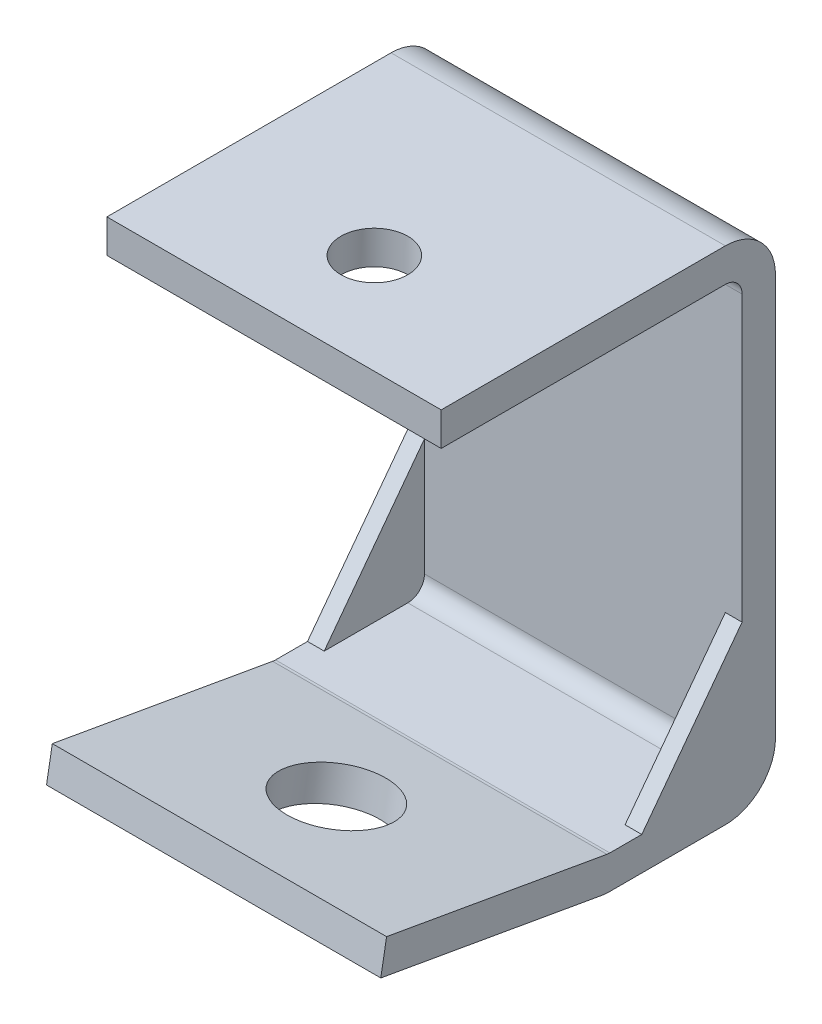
ISO-10303-21;
HEADER;
FILE_DESCRIPTION(('STEP AP214'),'2;1');
FILE_NAME('part.step','',(''),(''),'','','');
FILE_SCHEMA(('AUTOMOTIVE_DESIGN { 1 0 10303 214 1 1 1 1 }'));
ENDSEC;
DATA;
#1=APPLICATION_CONTEXT('core data for automotive mechanical design processes');
#2=APPLICATION_PROTOCOL_DEFINITION('international standard','automotive_design',2000,#1);
#3=PRODUCT_CONTEXT('',#1,'mechanical');
#4=PRODUCT('Part','Part','',(#3));
#5=PRODUCT_RELATED_PRODUCT_CATEGORY('part','',(#4));
#6=PRODUCT_DEFINITION_FORMATION('','',#4);
#7=PRODUCT_DEFINITION_CONTEXT('part definition',#1,'design');
#8=PRODUCT_DEFINITION('design','',#6,#7);
#9=PRODUCT_DEFINITION_SHAPE('','',#8);
#10=(LENGTH_UNIT() NAMED_UNIT(*) SI_UNIT(.MILLI.,.METRE.));
#11=(NAMED_UNIT(*) PLANE_ANGLE_UNIT() SI_UNIT($,.RADIAN.));
#12=(NAMED_UNIT(*) SI_UNIT($,.STERADIAN.) SOLID_ANGLE_UNIT());
#13=UNCERTAINTY_MEASURE_WITH_UNIT(LENGTH_MEASURE(1.E-05),#10,'distance_accuracy_value','');
#14=(GEOMETRIC_REPRESENTATION_CONTEXT(3) GLOBAL_UNCERTAINTY_ASSIGNED_CONTEXT((#13)) GLOBAL_UNIT_ASSIGNED_CONTEXT((#10,
#11,#12)) REPRESENTATION_CONTEXT('',''));
#15=CARTESIAN_POINT('',(0.,0.,0.));
#16=DIRECTION('',(0.,0.,1.));
#17=DIRECTION('',(1.,0.,0.));
#18=AXIS2_PLACEMENT_3D('',#15,#16,#17);
#19=CARTESIAN_POINT('',(31.75,3.175,3.175));
#20=DIRECTION('',(-1.,0.,0.));
#21=DIRECTION('',(0.,0.,1.));
#22=AXIS2_PLACEMENT_3D('',#19,#20,#21);
#23=CYLINDRICAL_SURFACE('',#22,3.175);
#24=DIRECTION('',(-1.,0.,0.));
#25=VECTOR('',#24,1.);
#26=CARTESIAN_POINT('',(31.75,3.175,0.));
#27=LINE('',#26,#25);
#28=CARTESIAN_POINT('',(28.575,3.175,0.));
#29=VERTEX_POINT('',#28);
#30=CARTESIAN_POINT('',(-28.575,3.175,0.));
#31=VERTEX_POINT('',#30);
#32=EDGE_CURVE('E320',#29,#31,#27,.T.);
#33=ORIENTED_EDGE('',*,*,#32,.T.);
#34=CARTESIAN_POINT('',(-28.575,3.175,3.175));
#35=DIRECTION('',(1.,0.,0.));
#36=DIRECTION('',(0.,0.,-1.));
#37=AXIS2_PLACEMENT_3D('',#34,#35,#36);
#38=CIRCLE('',#37,3.175);
#39=CARTESIAN_POINT('',(-28.575,0.,3.175));
#40=VERTEX_POINT('',#39);
#41=EDGE_CURVE('E192',#40,#31,#38,.T.);
#42=ORIENTED_EDGE('',*,*,#41,.F.);
#43=DIRECTION('',(-1.,0.,0.));
#44=VECTOR('',#43,1.);
#45=CARTESIAN_POINT('',(31.75,0.,3.175));
#46=LINE('',#45,#44);
#47=CARTESIAN_POINT('',(28.575,0.,3.175));
#48=VERTEX_POINT('',#47);
#49=EDGE_CURVE('E191',#48,#40,#46,.T.);
#50=ORIENTED_EDGE('',*,*,#49,.F.);
#51=CARTESIAN_POINT('',(28.575,3.175,3.175));
#52=DIRECTION('',(1.,0.,0.));
#53=DIRECTION('',(0.,0.,-1.));
#54=AXIS2_PLACEMENT_3D('',#51,#52,#53);
#55=CIRCLE('',#54,3.175);
#56=EDGE_CURVE('E203',#48,#29,#55,.T.);
#57=ORIENTED_EDGE('',*,*,#56,.T.);
#58=EDGE_LOOP('',(#33,#42,#50,#57));
#59=FACE_BOUND('',#58,.T.);
#60=ADVANCED_FACE('F32',(#59),#23,.F.);
#61=CARTESIAN_POINT('',(31.75,3.175,0.));
#62=DIRECTION('',(0.,0.,1.));
#63=DIRECTION('',(1.,0.,0.));
#64=AXIS2_PLACEMENT_3D('',#61,#62,#63);
#65=PLANE('',#64);
#66=DIRECTION('',(-1.,0.,0.));
#67=VECTOR('',#66,1.);
#68=CARTESIAN_POINT('',(-28.575,25.4,0.));
#69=LINE('',#68,#67);
#70=CARTESIAN_POINT('',(-28.575,25.4,0.));
#71=VERTEX_POINT('',#70);
#72=CARTESIAN_POINT('',(-31.75,25.4,0.));
#73=VERTEX_POINT('',#72);
#74=EDGE_CURVE('E179',#71,#73,#69,.T.);
#75=ORIENTED_EDGE('',*,*,#74,.F.);
#76=DIRECTION('',(0.,1.,0.));
#77=VECTOR('',#76,1.);
#78=CARTESIAN_POINT('',(-28.575,3.175,0.));
#79=LINE('',#78,#77);
#80=EDGE_CURVE('E186',#31,#71,#79,.T.);
#81=ORIENTED_EDGE('',*,*,#80,.F.);
#82=ORIENTED_EDGE('',*,*,#32,.F.);
#83=DIRECTION('',(0.,1.,0.));
#84=VECTOR('',#83,1.);
#85=CARTESIAN_POINT('',(28.575,3.175,0.));
#86=LINE('',#85,#84);
#87=CARTESIAN_POINT('',(28.575,25.4,0.));
#88=VERTEX_POINT('',#87);
#89=EDGE_CURVE('E56',#29,#88,#86,.T.);
#90=ORIENTED_EDGE('',*,*,#89,.T.);
#91=DIRECTION('',(1.,0.,0.));
#92=VECTOR('',#91,1.);
#93=CARTESIAN_POINT('',(28.575,25.4,0.));
#94=LINE('',#93,#92);
#95=CARTESIAN_POINT('',(31.75,25.4,0.));
#96=VERTEX_POINT('',#95);
#97=EDGE_CURVE('E212',#88,#96,#94,.T.);
#98=ORIENTED_EDGE('',*,*,#97,.T.);
#99=DIRECTION('',(0.,1.,0.));
#100=VECTOR('',#99,1.);
#101=CARTESIAN_POINT('',(31.75,3.175,0.));
#102=LINE('',#101,#100);
#103=CARTESIAN_POINT('',(31.75,79.375,0.));
#104=VERTEX_POINT('',#103);
#105=EDGE_CURVE('E233',#96,#104,#102,.T.);
#106=ORIENTED_EDGE('',*,*,#105,.T.);
#107=DIRECTION('',(-1.,0.,0.));
#108=VECTOR('',#107,1.);
#109=CARTESIAN_POINT('',(31.75,79.375,0.));
#110=LINE('',#109,#108);
#111=CARTESIAN_POINT('',(-31.75,79.375,0.));
#112=VERTEX_POINT('',#111);
#113=EDGE_CURVE('E323',#104,#112,#110,.T.);
#114=ORIENTED_EDGE('',*,*,#113,.T.);
#115=DIRECTION('',(0.,1.,0.));
#116=VECTOR('',#115,1.);
#117=CARTESIAN_POINT('',(-31.75,3.175,0.));
#118=LINE('',#117,#116);
#119=EDGE_CURVE('E270',#73,#112,#118,.T.);
#120=ORIENTED_EDGE('',*,*,#119,.F.);
#121=EDGE_LOOP('',(#75,#81,#82,#90,#98,#106,#114,#120));
#122=FACE_BOUND('',#121,.T.);
#123=ADVANCED_FACE('F413',(#122),#65,.T.);
#124=CARTESIAN_POINT('',(31.75,0.,25.1222234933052));
#125=DIRECTION('',(0.,1.,0.));
#126=DIRECTION('',(0.,0.,1.));
#127=AXIS2_PLACEMENT_3D('',#124,#125,#126);
#128=PLANE('',#127);
#129=DIRECTION('',(-1.,0.,0.));
#130=VECTOR('',#129,1.);
#131=CARTESIAN_POINT('',(-28.575,0.,19.05));
#132=LINE('',#131,#130);
#133=CARTESIAN_POINT('',(-28.575,0.,19.05));
#134=VERTEX_POINT('',#133);
#135=CARTESIAN_POINT('',(-31.75,0.,19.05));
#136=VERTEX_POINT('',#135);
#137=EDGE_CURVE('E170',#134,#136,#132,.T.);
#138=ORIENTED_EDGE('',*,*,#137,.T.);
#139=DIRECTION('',(0.,0.,-1.));
#140=VECTOR('',#139,1.);
#141=CARTESIAN_POINT('',(-31.75,0.,25.1222234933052));
#142=LINE('',#141,#140);
#143=CARTESIAN_POINT('',(-31.75,0.,25.1222234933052));
#144=VERTEX_POINT('',#143);
#145=EDGE_CURVE('E272',#144,#136,#142,.T.);
#146=ORIENTED_EDGE('',*,*,#145,.F.);
#147=DIRECTION('',(-1.,0.,0.));
#148=VECTOR('',#147,1.);
#149=CARTESIAN_POINT('',(31.75,0.,25.1222234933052));
#150=LINE('',#149,#148);
#151=CARTESIAN_POINT('',(31.75,0.,25.1222234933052));
#152=VERTEX_POINT('',#151);
#153=EDGE_CURVE('E317',#152,#144,#150,.T.);
#154=ORIENTED_EDGE('',*,*,#153,.F.);
#155=DIRECTION('',(0.,0.,-1.));
#156=VECTOR('',#155,1.);
#157=CARTESIAN_POINT('',(31.75,0.,25.1222234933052));
#158=LINE('',#157,#156);
#159=CARTESIAN_POINT('',(31.75,0.,19.05));
#160=VERTEX_POINT('',#159);
#161=EDGE_CURVE('E235',#152,#160,#158,.T.);
#162=ORIENTED_EDGE('',*,*,#161,.T.);
#163=DIRECTION('',(1.,0.,0.));
#164=VECTOR('',#163,1.);
#165=CARTESIAN_POINT('',(28.575,0.,19.05));
#166=LINE('',#165,#164);
#167=CARTESIAN_POINT('',(28.575,0.,19.05));
#168=VERTEX_POINT('',#167);
#169=EDGE_CURVE('E207',#168,#160,#166,.T.);
#170=ORIENTED_EDGE('',*,*,#169,.F.);
#171=DIRECTION('',(0.,0.,-1.));
#172=VECTOR('',#171,1.);
#173=CARTESIAN_POINT('',(28.575,0.,19.05));
#174=LINE('',#173,#172);
#175=EDGE_CURVE('E205',#168,#48,#174,.T.);
#176=ORIENTED_EDGE('',*,*,#175,.T.);
#177=ORIENTED_EDGE('',*,*,#49,.T.);
#178=DIRECTION('',(0.,0.,-1.));
#179=VECTOR('',#178,1.);
#180=CARTESIAN_POINT('',(-28.575,0.,19.05));
#181=LINE('',#180,#179);
#182=EDGE_CURVE('E183',#134,#40,#181,.T.);
#183=ORIENTED_EDGE('',*,*,#182,.F.);
#184=EDGE_LOOP('',(#138,#146,#154,#162,#170,#176,#177,#183));
#185=FACE_BOUND('',#184,.T.);
#186=ADVANCED_FACE('F189',(#185),#128,.T.);
#187=CARTESIAN_POINT('',(31.75,88.9,3.175));
#188=DIRECTION('',(0.,-1.,0.));
#189=DIRECTION('',(0.,0.,-1.));
#190=AXIS2_PLACEMENT_3D('',#187,#188,#189);
#191=PLANE('',#190);
#192=CARTESIAN_POINT('',(0.,88.9,38.1));
#193=DIRECTION('',(0.,1.,0.));
#194=DIRECTION('',(0.,0.,1.));
#195=AXIS2_PLACEMENT_3D('',#192,#193,#194);
#196=CIRCLE('',#195,6.35);
#197=CARTESIAN_POINT('',(0.,88.9,44.45));
#198=VERTEX_POINT('',#197);
#199=EDGE_CURVE('E217',#198,#198,#196,.T.);
#200=ORIENTED_EDGE('',*,*,#199,.F.);
#201=EDGE_LOOP('',(#200));
#202=FACE_BOUND('',#201,.T.);
#203=DIRECTION('',(0.,0.,1.));
#204=VECTOR('',#203,1.);
#205=CARTESIAN_POINT('',(-31.75,88.9,3.175));
#206=LINE('',#205,#204);
#207=CARTESIAN_POINT('',(-31.75,88.9,3.175));
#208=VERTEX_POINT('',#207);
#209=CARTESIAN_POINT('',(-31.75,88.9,57.15));
#210=VERTEX_POINT('',#209);
#211=EDGE_CURVE('E220',#208,#210,#206,.T.);
#212=ORIENTED_EDGE('',*,*,#211,.T.);
#213=DIRECTION('',(-1.,0.,0.));
#214=VECTOR('',#213,1.);
#215=CARTESIAN_POINT('',(31.75,88.9,57.15));
#216=LINE('',#215,#214);
#217=CARTESIAN_POINT('',(31.75,88.9,57.15));
#218=VERTEX_POINT('',#217);
#219=EDGE_CURVE('E11',#218,#210,#216,.T.);
#220=ORIENTED_EDGE('',*,*,#219,.F.);
#221=DIRECTION('',(0.,0.,1.));
#222=VECTOR('',#221,1.);
#223=CARTESIAN_POINT('',(31.75,88.9,3.175));
#224=LINE('',#223,#222);
#225=CARTESIAN_POINT('',(31.75,88.9,3.175));
#226=VERTEX_POINT('',#225);
#227=EDGE_CURVE('E221',#226,#218,#224,.T.);
#228=ORIENTED_EDGE('',*,*,#227,.F.);
#229=DIRECTION('',(-1.,0.,0.));
#230=VECTOR('',#229,1.);
#231=CARTESIAN_POINT('',(31.75,88.9,3.175));
#232=LINE('',#231,#230);
#233=EDGE_CURVE('E258',#226,#208,#232,.T.);
#234=ORIENTED_EDGE('',*,*,#233,.T.);
#235=EDGE_LOOP('',(#212,#220,#228,#234));
#236=FACE_BOUND('',#235,.T.);
#237=ADVANCED_FACE('F34',(#202,#236),#191,.F.);
#238=CARTESIAN_POINT('',(31.75,82.55,57.15));
#239=DIRECTION('',(0.,0.,1.));
#240=DIRECTION('',(1.,0.,0.));
#241=AXIS2_PLACEMENT_3D('',#238,#239,#240);
#242=PLANE('',#241);
#243=DIRECTION('',(0.,1.,0.));
#244=VECTOR('',#243,1.);
#245=CARTESIAN_POINT('',(-31.75,82.55,57.15));
#246=LINE('',#245,#244);
#247=CARTESIAN_POINT('',(-31.75,82.55,57.15));
#248=VERTEX_POINT('',#247);
#249=EDGE_CURVE('E261',#248,#210,#246,.T.);
#250=ORIENTED_EDGE('',*,*,#249,.F.);
#251=DIRECTION('',(-1.,0.,0.));
#252=VECTOR('',#251,1.);
#253=CARTESIAN_POINT('',(31.75,82.55,57.15));
#254=LINE('',#253,#252);
#255=CARTESIAN_POINT('',(31.75,82.55,57.15));
#256=VERTEX_POINT('',#255);
#257=EDGE_CURVE('E41',#256,#248,#254,.T.);
#258=ORIENTED_EDGE('',*,*,#257,.F.);
#259=DIRECTION('',(0.,1.,0.));
#260=VECTOR('',#259,1.);
#261=CARTESIAN_POINT('',(31.75,82.55,57.15));
#262=LINE('',#261,#260);
#263=EDGE_CURVE('E223',#256,#218,#262,.T.);
#264=ORIENTED_EDGE('',*,*,#263,.T.);
#265=ORIENTED_EDGE('',*,*,#219,.T.);
#266=EDGE_LOOP('',(#250,#258,#264,#265));
#267=FACE_BOUND('',#266,.T.);
#268=ADVANCED_FACE('F335',(#267),#242,.T.);
#269=CARTESIAN_POINT('',(31.75,82.55,3.175));
#270=DIRECTION('',(0.,-1.,0.));
#271=DIRECTION('',(0.,0.,-1.));
#272=AXIS2_PLACEMENT_3D('',#269,#270,#271);
#273=PLANE('',#272);
#274=CARTESIAN_POINT('',(0.,82.55,38.1));
#275=DIRECTION('',(0.,-1.,0.));
#276=DIRECTION('',(0.,0.,-1.));
#277=AXIS2_PLACEMENT_3D('',#274,#275,#276);
#278=CIRCLE('',#277,6.35);
#279=CARTESIAN_POINT('',(0.,82.55,31.75));
#280=VERTEX_POINT('',#279);
#281=EDGE_CURVE('E214',#280,#280,#278,.F.);
#282=ORIENTED_EDGE('',*,*,#281,.T.);
#283=EDGE_LOOP('',(#282));
#284=FACE_BOUND('',#283,.T.);
#285=DIRECTION('',(0.,0.,1.));
#286=VECTOR('',#285,1.);
#287=CARTESIAN_POINT('',(-31.75,82.55,3.175));
#288=LINE('',#287,#286);
#289=CARTESIAN_POINT('',(-31.75,82.55,3.175));
#290=VERTEX_POINT('',#289);
#291=EDGE_CURVE('E264',#290,#248,#288,.T.);
#292=ORIENTED_EDGE('',*,*,#291,.F.);
#293=DIRECTION('',(-1.,0.,0.));
#294=VECTOR('',#293,1.);
#295=CARTESIAN_POINT('',(31.75,82.55,3.175));
#296=LINE('',#295,#294);
#297=CARTESIAN_POINT('',(31.75,82.55,3.175));
#298=VERTEX_POINT('',#297);
#299=EDGE_CURVE('E326',#298,#290,#296,.T.);
#300=ORIENTED_EDGE('',*,*,#299,.F.);
#301=DIRECTION('',(0.,0.,1.));
#302=VECTOR('',#301,1.);
#303=CARTESIAN_POINT('',(31.75,82.55,3.175));
#304=LINE('',#303,#302);
#305=EDGE_CURVE('E227',#298,#256,#304,.T.);
#306=ORIENTED_EDGE('',*,*,#305,.T.);
#307=ORIENTED_EDGE('',*,*,#257,.T.);
#308=EDGE_LOOP('',(#292,#300,#306,#307));
#309=FACE_BOUND('',#308,.T.);
#310=ADVANCED_FACE('F331',(#284,#309),#273,.T.);
#311=CARTESIAN_POINT('',(31.75,79.375,3.175));
#312=DIRECTION('',(-1.,0.,0.));
#313=DIRECTION('',(0.,0.,1.));
#314=AXIS2_PLACEMENT_3D('',#311,#312,#313);
#315=CYLINDRICAL_SURFACE('',#314,3.175);
#316=CARTESIAN_POINT('',(-31.75,79.375,3.175));
#317=DIRECTION('',(1.,0.,0.));
#318=DIRECTION('',(0.,0.,-1.));
#319=AXIS2_PLACEMENT_3D('',#316,#317,#318);
#320=CIRCLE('',#319,3.175);
#321=EDGE_CURVE('E267',#112,#290,#320,.T.);
#322=ORIENTED_EDGE('',*,*,#321,.F.);
#323=ORIENTED_EDGE('',*,*,#113,.F.);
#324=CARTESIAN_POINT('',(31.75,79.375,3.175));
#325=DIRECTION('',(1.,0.,0.));
#326=DIRECTION('',(0.,0.,-1.));
#327=AXIS2_PLACEMENT_3D('',#324,#325,#326);
#328=CIRCLE('',#327,3.175);
#329=EDGE_CURVE('E230',#104,#298,#328,.T.);
#330=ORIENTED_EDGE('',*,*,#329,.T.);
#331=ORIENTED_EDGE('',*,*,#299,.T.);
#332=EDGE_LOOP('',(#322,#323,#330,#331));
#333=FACE_BOUND('',#332,.T.);
#334=ADVANCED_FACE('F343',(#333),#315,.F.);
#335=CARTESIAN_POINT('',(31.75,3.175,25.1222234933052));
#336=DIRECTION('',(-1.,0.,0.));
#337=DIRECTION('',(0.,0.,1.));
#338=AXIS2_PLACEMENT_3D('',#335,#336,#337);
#339=CYLINDRICAL_SURFACE('',#338,3.175);
#340=CARTESIAN_POINT('',(-31.75,3.175,25.1222234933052));
#341=DIRECTION('',(1.,0.,0.));
#342=DIRECTION('',(0.,0.,-1.));
#343=AXIS2_PLACEMENT_3D('',#340,#341,#342);
#344=CIRCLE('',#343,3.175);
#345=CARTESIAN_POINT('',(-31.75,0.0482353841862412,25.6735564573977));
#346=VERTEX_POINT('',#345);
#347=EDGE_CURVE('E274',#346,#144,#344,.T.);
#348=ORIENTED_EDGE('',*,*,#347,.F.);
#349=DIRECTION('',(-1.,0.,0.));
#350=VECTOR('',#349,1.);
#351=CARTESIAN_POINT('',(31.75,0.0482353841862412,25.6735564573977));
#352=LINE('',#351,#350);
#353=CARTESIAN_POINT('',(31.75,0.0482353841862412,25.6735564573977));
#354=VERTEX_POINT('',#353);
#355=EDGE_CURVE('E315',#354,#346,#352,.T.);
#356=ORIENTED_EDGE('',*,*,#355,.F.);
#357=CARTESIAN_POINT('',(31.75,3.175,25.1222234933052));
#358=DIRECTION('',(1.,0.,0.));
#359=DIRECTION('',(0.,0.,-1.));
#360=AXIS2_PLACEMENT_3D('',#357,#358,#359);
#361=CIRCLE('',#360,3.175);
#362=EDGE_CURVE('E237',#354,#152,#361,.T.);
#363=ORIENTED_EDGE('',*,*,#362,.T.);
#364=ORIENTED_EDGE('',*,*,#153,.T.);
#365=EDGE_LOOP('',(#348,#356,#363,#364));
#366=FACE_BOUND('',#365,.T.);
#367=ADVANCED_FACE('F390',(#366),#339,.F.);
#368=CARTESIAN_POINT('',(31.75,7.42755769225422,67.523772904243));
#369=DIRECTION('',(0.,0.984807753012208,-0.173648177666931));
#370=DIRECTION('',(0.,0.173648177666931,0.984807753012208));
#371=AXIS2_PLACEMENT_3D('',#368,#369,#370);
#372=PLANE('',#371);
#373=CARTESIAN_POINT('',(0.,3.51215941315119,45.3184458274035));
#374=DIRECTION('',(0.,0.984807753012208,-0.173648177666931));
#375=DIRECTION('',(0.,0.173648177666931,0.984807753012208));
#376=AXIS2_PLACEMENT_3D('',#373,#374,#375);
#377=CIRCLE('',#376,9.525);
#378=CARTESIAN_POINT('',(0.,5.1661583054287,54.6987396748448));
#379=VERTEX_POINT('',#378);
#380=EDGE_CURVE('E547',#379,#379,#377,.T.);
#381=ORIENTED_EDGE('',*,*,#380,.F.);
#382=EDGE_LOOP('',(#381));
#383=FACE_BOUND('',#382,.T.);
#384=DIRECTION('',(0.,-0.173648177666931,-0.984807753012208));
#385=VECTOR('',#384,1.);
#386=CARTESIAN_POINT('',(-31.75,7.42755769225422,67.523772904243));
#387=LINE('',#386,#385);
#388=CARTESIAN_POINT('',(-31.75,7.42755769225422,67.523772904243));
#389=VERTEX_POINT('',#388);
#390=EDGE_CURVE('E277',#389,#346,#387,.T.);
#391=ORIENTED_EDGE('',*,*,#390,.F.);
#392=DIRECTION('',(-1.,0.,0.));
#393=VECTOR('',#392,1.);
#394=CARTESIAN_POINT('',(31.75,7.42755769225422,67.523772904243));
#395=LINE('',#394,#393);
#396=CARTESIAN_POINT('',(31.75,7.42755769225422,67.523772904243));
#397=VERTEX_POINT('',#396);
#398=EDGE_CURVE('E313',#397,#389,#395,.T.);
#399=ORIENTED_EDGE('',*,*,#398,.F.);
#400=DIRECTION('',(0.,-0.173648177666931,-0.984807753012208));
#401=VECTOR('',#400,1.);
#402=CARTESIAN_POINT('',(31.75,7.42755769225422,67.523772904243));
#403=LINE('',#402,#401);
#404=EDGE_CURVE('E240',#397,#354,#403,.T.);
#405=ORIENTED_EDGE('',*,*,#404,.T.);
#406=ORIENTED_EDGE('',*,*,#355,.T.);
#407=EDGE_LOOP('',(#391,#399,#405,#406));
#408=FACE_BOUND('',#407,.T.);
#409=ADVANCED_FACE('F387',(#383,#408),#372,.T.);
#410=CARTESIAN_POINT('',(31.75,1.1740284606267,68.626438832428));
#411=DIRECTION('',(0.,0.17364817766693,0.984807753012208));
#412=DIRECTION('',(0.,-0.984807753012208,0.17364817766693));
#413=AXIS2_PLACEMENT_3D('',#410,#411,#412);
#414=PLANE('',#413);
#415=DIRECTION('',(0.,0.984807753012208,-0.17364817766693));
#416=VECTOR('',#415,1.);
#417=CARTESIAN_POINT('',(-31.75,1.1740284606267,68.626438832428));
#418=LINE('',#417,#416);
#419=CARTESIAN_POINT('',(-31.75,1.1740284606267,68.626438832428));
#420=VERTEX_POINT('',#419);
#421=EDGE_CURVE('E280',#420,#389,#418,.T.);
#422=ORIENTED_EDGE('',*,*,#421,.F.);
#423=DIRECTION('',(-1.,0.,0.));
#424=VECTOR('',#423,1.);
#425=CARTESIAN_POINT('',(31.75,1.1740284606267,68.626438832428));
#426=LINE('',#425,#424);
#427=CARTESIAN_POINT('',(31.75,1.1740284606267,68.626438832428));
#428=VERTEX_POINT('',#427);
#429=EDGE_CURVE('E311',#428,#420,#426,.T.);
#430=ORIENTED_EDGE('',*,*,#429,.F.);
#431=DIRECTION('',(0.,0.984807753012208,-0.17364817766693));
#432=VECTOR('',#431,1.);
#433=CARTESIAN_POINT('',(31.75,1.1740284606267,68.626438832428));
#434=LINE('',#433,#432);
#435=EDGE_CURVE('E243',#428,#397,#434,.T.);
#436=ORIENTED_EDGE('',*,*,#435,.T.);
#437=ORIENTED_EDGE('',*,*,#398,.T.);
#438=EDGE_LOOP('',(#422,#430,#436,#437));
#439=FACE_BOUND('',#438,.T.);
#440=ADVANCED_FACE('F383',(#439),#414,.T.);
#441=CARTESIAN_POINT('',(31.75,1.1740284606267,68.626438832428));
#442=DIRECTION('',(0.,0.984807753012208,-0.173648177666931));
#443=DIRECTION('',(0.,0.173648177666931,0.984807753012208));
#444=AXIS2_PLACEMENT_3D('',#441,#442,#443);
#445=PLANE('',#444);
#446=CARTESIAN_POINT('',(0.,-2.74136981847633,46.4211117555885));
#447=DIRECTION('',(0.,0.984807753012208,-0.173648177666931));
#448=DIRECTION('',(0.,0.173648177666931,0.984807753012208));
#449=AXIS2_PLACEMENT_3D('',#446,#447,#448);
#450=CIRCLE('',#449,9.525);
#451=CARTESIAN_POINT('',(0.,-1.08737092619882,55.8014056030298));
#452=VERTEX_POINT('',#451);
#453=EDGE_CURVE('E36',#452,#452,#450,.T.);
#454=ORIENTED_EDGE('',*,*,#453,.T.);
#455=EDGE_LOOP('',(#454));
#456=FACE_BOUND('',#455,.T.);
#457=DIRECTION('',(0.,-0.173648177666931,-0.984807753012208));
#458=VECTOR('',#457,1.);
#459=CARTESIAN_POINT('',(-31.75,1.1740284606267,68.626438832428));
#460=LINE('',#459,#458);
#461=CARTESIAN_POINT('',(-31.75,-6.20529384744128,26.7762223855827));
#462=VERTEX_POINT('',#461);
#463=EDGE_CURVE('E283',#420,#462,#460,.T.);
#464=ORIENTED_EDGE('',*,*,#463,.T.);
#465=DIRECTION('',(-1.,0.,0.));
#466=VECTOR('',#465,1.);
#467=CARTESIAN_POINT('',(31.75,-6.20529384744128,26.7762223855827));
#468=LINE('',#467,#466);
#469=CARTESIAN_POINT('',(31.75,-6.20529384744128,26.7762223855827));
#470=VERTEX_POINT('',#469);
#471=EDGE_CURVE('E308',#470,#462,#468,.T.);
#472=ORIENTED_EDGE('',*,*,#471,.F.);
#473=DIRECTION('',(0.,-0.173648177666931,-0.984807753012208));
#474=VECTOR('',#473,1.);
#475=CARTESIAN_POINT('',(31.75,1.1740284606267,68.626438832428));
#476=LINE('',#475,#474);
#477=EDGE_CURVE('E246',#428,#470,#476,.T.);
#478=ORIENTED_EDGE('',*,*,#477,.F.);
#479=ORIENTED_EDGE('',*,*,#429,.T.);
#480=EDGE_LOOP('',(#464,#472,#478,#479));
#481=FACE_BOUND('',#480,.T.);
#482=ADVANCED_FACE('F379',(#456,#481),#445,.F.);
#483=CARTESIAN_POINT('',(31.75,3.175,25.1222234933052));
#484=DIRECTION('',(-1.,0.,0.));
#485=DIRECTION('',(0.,0.,1.));
#486=AXIS2_PLACEMENT_3D('',#483,#484,#485);
#487=CYLINDRICAL_SURFACE('',#486,9.525);
#488=CARTESIAN_POINT('',(-31.75,3.175,25.1222234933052));
#489=DIRECTION('',(1.,0.,0.));
#490=DIRECTION('',(0.,0.,-1.));
#491=AXIS2_PLACEMENT_3D('',#488,#489,#490);
#492=CIRCLE('',#491,9.525);
#493=CARTESIAN_POINT('',(-31.75,-6.35,25.1222234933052));
#494=VERTEX_POINT('',#493);
#495=EDGE_CURVE('E285',#462,#494,#492,.T.);
#496=ORIENTED_EDGE('',*,*,#495,.T.);
#497=DIRECTION('',(-1.,0.,0.));
#498=VECTOR('',#497,1.);
#499=CARTESIAN_POINT('',(31.75,-6.35,25.1222234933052));
#500=LINE('',#499,#498);
#501=CARTESIAN_POINT('',(31.75,-6.35,25.1222234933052));
#502=VERTEX_POINT('',#501);
#503=EDGE_CURVE('E305',#502,#494,#500,.T.);
#504=ORIENTED_EDGE('',*,*,#503,.F.);
#505=CARTESIAN_POINT('',(31.75,3.175,25.1222234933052));
#506=DIRECTION('',(1.,0.,0.));
#507=DIRECTION('',(0.,0.,-1.));
#508=AXIS2_PLACEMENT_3D('',#505,#506,#507);
#509=CIRCLE('',#508,9.525);
#510=EDGE_CURVE('E248',#470,#502,#509,.T.);
#511=ORIENTED_EDGE('',*,*,#510,.F.);
#512=ORIENTED_EDGE('',*,*,#471,.T.);
#513=EDGE_LOOP('',(#496,#504,#511,#512));
#514=FACE_BOUND('',#513,.T.);
#515=ADVANCED_FACE('F375',(#514),#487,.T.);
#516=CARTESIAN_POINT('',(31.75,-6.35,25.1222234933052));
#517=DIRECTION('',(0.,1.,0.));
#518=DIRECTION('',(0.,0.,1.));
#519=AXIS2_PLACEMENT_3D('',#516,#517,#518);
#520=PLANE('',#519);
#521=DIRECTION('',(0.,0.,-1.));
#522=VECTOR('',#521,1.);
#523=CARTESIAN_POINT('',(-31.75,-6.35,25.1222234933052));
#524=LINE('',#523,#522);
#525=CARTESIAN_POINT('',(-31.75,-6.35,3.175));
#526=VERTEX_POINT('',#525);
#527=EDGE_CURVE('E287',#494,#526,#524,.T.);
#528=ORIENTED_EDGE('',*,*,#527,.T.);
#529=DIRECTION('',(-1.,0.,0.));
#530=VECTOR('',#529,1.);
#531=CARTESIAN_POINT('',(31.75,-6.35,3.175));
#532=LINE('',#531,#530);
#533=CARTESIAN_POINT('',(31.75,-6.35,3.175));
#534=VERTEX_POINT('',#533);
#535=EDGE_CURVE('E302',#534,#526,#532,.T.);
#536=ORIENTED_EDGE('',*,*,#535,.F.);
#537=DIRECTION('',(0.,0.,-1.));
#538=VECTOR('',#537,1.);
#539=CARTESIAN_POINT('',(31.75,-6.35,25.1222234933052));
#540=LINE('',#539,#538);
#541=EDGE_CURVE('E250',#502,#534,#540,.T.);
#542=ORIENTED_EDGE('',*,*,#541,.F.);
#543=ORIENTED_EDGE('',*,*,#503,.T.);
#544=EDGE_LOOP('',(#528,#536,#542,#543));
#545=FACE_BOUND('',#544,.T.);
#546=ADVANCED_FACE('F370',(#545),#520,.F.);
#547=CARTESIAN_POINT('',(31.75,3.175,3.175));
#548=DIRECTION('',(-1.,0.,0.));
#549=DIRECTION('',(0.,0.,1.));
#550=AXIS2_PLACEMENT_3D('',#547,#548,#549);
#551=CYLINDRICAL_SURFACE('',#550,9.525);
#552=CARTESIAN_POINT('',(-31.75,3.175,3.175));
#553=DIRECTION('',(1.,0.,0.));
#554=DIRECTION('',(0.,0.,-1.));
#555=AXIS2_PLACEMENT_3D('',#552,#553,#554);
#556=CIRCLE('',#555,9.525);
#557=CARTESIAN_POINT('',(-31.75,3.175,-6.35));
#558=VERTEX_POINT('',#557);
#559=EDGE_CURVE('E289',#526,#558,#556,.T.);
#560=ORIENTED_EDGE('',*,*,#559,.T.);
#561=DIRECTION('',(-1.,0.,0.));
#562=VECTOR('',#561,1.);
#563=CARTESIAN_POINT('',(31.75,3.175,-6.35));
#564=LINE('',#563,#562);
#565=CARTESIAN_POINT('',(31.75,3.175,-6.35));
#566=VERTEX_POINT('',#565);
#567=EDGE_CURVE('E299',#566,#558,#564,.T.);
#568=ORIENTED_EDGE('',*,*,#567,.F.);
#569=CARTESIAN_POINT('',(31.75,3.175,3.175));
#570=DIRECTION('',(1.,0.,0.));
#571=DIRECTION('',(0.,0.,-1.));
#572=AXIS2_PLACEMENT_3D('',#569,#570,#571);
#573=CIRCLE('',#572,9.525);
#574=EDGE_CURVE('E252',#534,#566,#573,.T.);
#575=ORIENTED_EDGE('',*,*,#574,.F.);
#576=ORIENTED_EDGE('',*,*,#535,.T.);
#577=EDGE_LOOP('',(#560,#568,#575,#576));
#578=FACE_BOUND('',#577,.T.);
#579=ADVANCED_FACE('F364',(#578),#551,.T.);
#580=CARTESIAN_POINT('',(31.75,3.175,-6.35));
#581=DIRECTION('',(0.,0.,1.));
#582=DIRECTION('',(1.,0.,0.));
#583=AXIS2_PLACEMENT_3D('',#580,#581,#582);
#584=PLANE('',#583);
#585=DIRECTION('',(0.,1.,0.));
#586=VECTOR('',#585,1.);
#587=CARTESIAN_POINT('',(-31.75,3.175,-6.35));
#588=LINE('',#587,#586);
#589=CARTESIAN_POINT('',(-31.75,79.375,-6.35));
#590=VERTEX_POINT('',#589);
#591=EDGE_CURVE('E291',#558,#590,#588,.T.);
#592=ORIENTED_EDGE('',*,*,#591,.T.);
#593=DIRECTION('',(-1.,0.,0.));
#594=VECTOR('',#593,1.);
#595=CARTESIAN_POINT('',(31.75,79.375,-6.35));
#596=LINE('',#595,#594);
#597=CARTESIAN_POINT('',(31.75,79.375,-6.35));
#598=VERTEX_POINT('',#597);
#599=EDGE_CURVE('E296',#598,#590,#596,.T.);
#600=ORIENTED_EDGE('',*,*,#599,.F.);
#601=DIRECTION('',(0.,1.,0.));
#602=VECTOR('',#601,1.);
#603=CARTESIAN_POINT('',(31.75,3.175,-6.35));
#604=LINE('',#603,#602);
#605=EDGE_CURVE('E254',#566,#598,#604,.T.);
#606=ORIENTED_EDGE('',*,*,#605,.F.);
#607=ORIENTED_EDGE('',*,*,#567,.T.);
#608=EDGE_LOOP('',(#592,#600,#606,#607));
#609=FACE_BOUND('',#608,.T.);
#610=ADVANCED_FACE('F360',(#609),#584,.F.);
#611=CARTESIAN_POINT('',(31.75,79.375,3.175));
#612=DIRECTION('',(-1.,0.,0.));
#613=DIRECTION('',(0.,0.,1.));
#614=AXIS2_PLACEMENT_3D('',#611,#612,#613);
#615=CYLINDRICAL_SURFACE('',#614,9.525);
#616=CARTESIAN_POINT('',(-31.75,79.375,3.175));
#617=DIRECTION('',(1.,0.,0.));
#618=DIRECTION('',(0.,0.,-1.));
#619=AXIS2_PLACEMENT_3D('',#616,#617,#618);
#620=CIRCLE('',#619,9.525);
#621=EDGE_CURVE('E224',#590,#208,#620,.T.);
#622=ORIENTED_EDGE('',*,*,#621,.T.);
#623=ORIENTED_EDGE('',*,*,#233,.F.);
#624=CARTESIAN_POINT('',(31.75,79.375,3.175));
#625=DIRECTION('',(1.,0.,0.));
#626=DIRECTION('',(0.,0.,-1.));
#627=AXIS2_PLACEMENT_3D('',#624,#625,#626);
#628=CIRCLE('',#627,9.525);
#629=EDGE_CURVE('E256',#598,#226,#628,.T.);
#630=ORIENTED_EDGE('',*,*,#629,.F.);
#631=ORIENTED_EDGE('',*,*,#599,.T.);
#632=EDGE_LOOP('',(#622,#623,#630,#631));
#633=FACE_BOUND('',#632,.T.);
#634=ADVANCED_FACE('F356',(#633),#615,.T.);
#635=CARTESIAN_POINT('',(31.75,79.375,3.175));
#636=DIRECTION('',(1.,0.,0.));
#637=DIRECTION('',(0.,0.,-1.));
#638=AXIS2_PLACEMENT_3D('',#635,#636,#637);
#639=PLANE('',#638);
#640=ORIENTED_EDGE('',*,*,#105,.F.);
#641=DIRECTION('',(0.,0.8,-0.6));
#642=VECTOR('',#641,1.);
#643=CARTESIAN_POINT('',(31.75,0.,19.05));
#644=LINE('',#643,#642);
#645=EDGE_CURVE('E178',#160,#96,#644,.T.);
#646=ORIENTED_EDGE('',*,*,#645,.F.);
#647=ORIENTED_EDGE('',*,*,#161,.F.);
#648=ORIENTED_EDGE('',*,*,#362,.F.);
#649=ORIENTED_EDGE('',*,*,#404,.F.);
#650=ORIENTED_EDGE('',*,*,#435,.F.);
#651=ORIENTED_EDGE('',*,*,#477,.T.);
#652=ORIENTED_EDGE('',*,*,#510,.T.);
#653=ORIENTED_EDGE('',*,*,#541,.T.);
#654=ORIENTED_EDGE('',*,*,#574,.T.);
#655=ORIENTED_EDGE('',*,*,#605,.T.);
#656=ORIENTED_EDGE('',*,*,#629,.T.);
#657=ORIENTED_EDGE('',*,*,#227,.T.);
#658=ORIENTED_EDGE('',*,*,#263,.F.);
#659=ORIENTED_EDGE('',*,*,#305,.F.);
#660=ORIENTED_EDGE('',*,*,#329,.F.);
#661=EDGE_LOOP('',(#640,#646,#647,#648,#649,#650,#651,#652,#653,#654,#655,#656,#657,#658,#659,#660));
#662=FACE_BOUND('',#661,.T.);
#663=ADVANCED_FACE('F347',(#662),#639,.T.);
#664=CARTESIAN_POINT('',(-31.75,79.375,3.175));
#665=DIRECTION('',(1.,0.,0.));
#666=DIRECTION('',(0.,0.,-1.));
#667=AXIS2_PLACEMENT_3D('',#664,#665,#666);
#668=PLANE('',#667);
#669=ORIENTED_EDGE('',*,*,#211,.F.);
#670=ORIENTED_EDGE('',*,*,#621,.F.);
#671=ORIENTED_EDGE('',*,*,#591,.F.);
#672=ORIENTED_EDGE('',*,*,#559,.F.);
#673=ORIENTED_EDGE('',*,*,#527,.F.);
#674=ORIENTED_EDGE('',*,*,#495,.F.);
#675=ORIENTED_EDGE('',*,*,#463,.F.);
#676=ORIENTED_EDGE('',*,*,#421,.T.);
#677=ORIENTED_EDGE('',*,*,#390,.T.);
#678=ORIENTED_EDGE('',*,*,#347,.T.);
#679=ORIENTED_EDGE('',*,*,#145,.T.);
#680=DIRECTION('',(0.,0.8,-0.6));
#681=VECTOR('',#680,1.);
#682=CARTESIAN_POINT('',(-31.75,0.,19.05));
#683=LINE('',#682,#681);
#684=EDGE_CURVE('E48',#136,#73,#683,.T.);
#685=ORIENTED_EDGE('',*,*,#684,.T.);
#686=ORIENTED_EDGE('',*,*,#119,.T.);
#687=ORIENTED_EDGE('',*,*,#321,.T.);
#688=ORIENTED_EDGE('',*,*,#291,.T.);
#689=ORIENTED_EDGE('',*,*,#249,.T.);
#690=EDGE_LOOP('',(#669,#670,#671,#672,#673,#674,#675,#676,#677,#678,#679,#685,#686,#687,#688,#689));
#691=FACE_BOUND('',#690,.T.);
#692=ADVANCED_FACE('F338',(#691),#668,.F.);
#693=CARTESIAN_POINT('',(0.,-6.35100000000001,38.1000000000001));
#694=DIRECTION('',(0.,1.,0.));
#695=DIRECTION('',(0.,0.,1.));
#696=AXIS2_PLACEMENT_3D('',#693,#694,#695);
#697=CYLINDRICAL_SURFACE('',#696,6.35);
#698=ORIENTED_EDGE('',*,*,#281,.F.);
#699=EDGE_LOOP('',(#698));
#700=FACE_BOUND('',#699,.T.);
#701=ORIENTED_EDGE('',*,*,#199,.T.);
#702=EDGE_LOOP('',(#701));
#703=FACE_BOUND('',#702,.T.);
#704=ADVANCED_FACE('F410',(#700,#703),#697,.F.);
#705=CARTESIAN_POINT('',(28.575,0.,19.05));
#706=DIRECTION('',(0.,-0.6,-0.8));
#707=DIRECTION('',(0.,0.8,-0.6));
#708=AXIS2_PLACEMENT_3D('',#705,#706,#707);
#709=PLANE('',#708);
#710=ORIENTED_EDGE('',*,*,#645,.T.);
#711=ORIENTED_EDGE('',*,*,#97,.F.);
#712=DIRECTION('',(0.,0.8,-0.6));
#713=VECTOR('',#712,1.);
#714=CARTESIAN_POINT('',(28.575,0.,19.05));
#715=LINE('',#714,#713);
#716=EDGE_CURVE('E200',#168,#88,#715,.T.);
#717=ORIENTED_EDGE('',*,*,#716,.F.);
#718=ORIENTED_EDGE('',*,*,#169,.T.);
#719=EDGE_LOOP('',(#710,#711,#717,#718));
#720=FACE_BOUND('',#719,.T.);
#721=ADVANCED_FACE('F396',(#720),#709,.F.);
#722=CARTESIAN_POINT('',(28.575,3.175,3.175));
#723=DIRECTION('',(1.,0.,0.));
#724=DIRECTION('',(0.,0.,-1.));
#725=AXIS2_PLACEMENT_3D('',#722,#723,#724);
#726=PLANE('',#725);
#727=ORIENTED_EDGE('',*,*,#716,.T.);
#728=ORIENTED_EDGE('',*,*,#89,.F.);
#729=ORIENTED_EDGE('',*,*,#56,.F.);
#730=ORIENTED_EDGE('',*,*,#175,.F.);
#731=EDGE_LOOP('',(#727,#728,#729,#730));
#732=FACE_BOUND('',#731,.T.);
#733=ADVANCED_FACE('F402',(#732),#726,.F.);
#734=CARTESIAN_POINT('',(-28.575,0.,19.05));
#735=DIRECTION('',(0.,0.6,0.8));
#736=DIRECTION('',(0.,-0.8,0.6));
#737=AXIS2_PLACEMENT_3D('',#734,#735,#736);
#738=PLANE('',#737);
#739=ORIENTED_EDGE('',*,*,#684,.F.);
#740=ORIENTED_EDGE('',*,*,#137,.F.);
#741=DIRECTION('',(0.,0.8,-0.6));
#742=VECTOR('',#741,1.);
#743=CARTESIAN_POINT('',(-28.575,0.,19.05));
#744=LINE('',#743,#742);
#745=EDGE_CURVE('E173',#134,#71,#744,.T.);
#746=ORIENTED_EDGE('',*,*,#745,.T.);
#747=ORIENTED_EDGE('',*,*,#74,.T.);
#748=EDGE_LOOP('',(#739,#740,#746,#747));
#749=FACE_BOUND('',#748,.T.);
#750=ADVANCED_FACE('F172',(#749),#738,.T.);
#751=CARTESIAN_POINT('',(-28.575,3.175,3.175));
#752=DIRECTION('',(-1.,0.,0.));
#753=DIRECTION('',(0.,0.,-1.));
#754=AXIS2_PLACEMENT_3D('',#751,#752,#753);
#755=PLANE('',#754);
#756=ORIENTED_EDGE('',*,*,#745,.F.);
#757=ORIENTED_EDGE('',*,*,#182,.T.);
#758=ORIENTED_EDGE('',*,*,#41,.T.);
#759=ORIENTED_EDGE('',*,*,#80,.T.);
#760=EDGE_LOOP('',(#756,#757,#758,#759));
#761=FACE_BOUND('',#760,.T.);
#762=ADVANCED_FACE('F182',(#761),#755,.F.);
#763=CARTESIAN_POINT('',(0.,-10.0385210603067,47.7077964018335));
#764=DIRECTION('',(0.,0.984807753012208,-0.173648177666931));
#765=DIRECTION('',(0.,0.173648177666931,0.984807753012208));
#766=AXIS2_PLACEMENT_3D('',#763,#764,#765);
#767=CYLINDRICAL_SURFACE('',#766,9.525);
#768=CARTESIAN_POINT('',(0.,5.1661583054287,54.6987396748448));
#769=CARTESIAN_POINT('',(0.,5.10101737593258,54.7102257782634));
#770=CARTESIAN_POINT('',(0.,5.03587644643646,54.7217118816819));
#771=CARTESIAN_POINT('',(0.,4.90559458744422,54.7446840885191));
#772=CARTESIAN_POINT('',(0.,4.84045365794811,54.7561701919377));
#773=CARTESIAN_POINT('',(0.,4.71017179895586,54.7791423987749));
#774=CARTESIAN_POINT('',(0.,4.64503086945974,54.7906285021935));
#775=CARTESIAN_POINT('',(0.,4.5147490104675,54.8136007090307));
#776=CARTESIAN_POINT('',(0.,4.44960808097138,54.8250868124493));
#777=CARTESIAN_POINT('',(0.,4.31932622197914,54.8480590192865));
#778=CARTESIAN_POINT('',(0.,4.25418529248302,54.8595451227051));
#779=CARTESIAN_POINT('',(0.,4.12390343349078,54.8825173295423));
#780=CARTESIAN_POINT('',(0.,4.05876250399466,54.8940034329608));
#781=CARTESIAN_POINT('',(0.,3.92848064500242,54.916975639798));
#782=CARTESIAN_POINT('',(0.,3.8633397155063,54.9284617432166));
#783=CARTESIAN_POINT('',(0.,3.73305785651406,54.9514339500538));
#784=CARTESIAN_POINT('',(0.,3.66791692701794,54.9629200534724));
#785=CARTESIAN_POINT('',(0.,3.5376350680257,54.9858922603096));
#786=CARTESIAN_POINT('',(0.,3.47249413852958,54.9973783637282));
#787=CARTESIAN_POINT('',(0.,3.34221227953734,55.0203505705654));
#788=CARTESIAN_POINT('',(0.,3.27707135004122,55.031836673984));
#789=CARTESIAN_POINT('',(0.,3.14678949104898,55.0548088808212));
#790=CARTESIAN_POINT('',(0.,3.08164856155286,55.0662949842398));
#791=CARTESIAN_POINT('',(0.,2.95136670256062,55.0892671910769));
#792=CARTESIAN_POINT('',(0.,2.8862257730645,55.1007532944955));
#793=CARTESIAN_POINT('',(0.,2.75594391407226,55.1237255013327));
#794=CARTESIAN_POINT('',(0.,2.69080298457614,55.1352116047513));
#795=CARTESIAN_POINT('',(0.,2.5605211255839,55.1581838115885));
#796=CARTESIAN_POINT('',(0.,2.49538019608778,55.1696699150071));
#797=CARTESIAN_POINT('',(0.,2.36509833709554,55.1926421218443));
#798=CARTESIAN_POINT('',(0.,2.29995740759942,55.2041282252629));
#799=CARTESIAN_POINT('',(0.,2.16967554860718,55.2271004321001));
#800=CARTESIAN_POINT('',(0.,2.10453461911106,55.2385865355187));
#801=CARTESIAN_POINT('',(0.,1.97425276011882,55.2615587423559));
#802=CARTESIAN_POINT('',(0.,1.9091118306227,55.2730448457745));
#803=CARTESIAN_POINT('',(0.,1.77882997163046,55.2960170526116));
#804=CARTESIAN_POINT('',(0.,1.71368904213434,55.3075031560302));
#805=CARTESIAN_POINT('',(0.,1.5834071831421,55.3304753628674));
#806=CARTESIAN_POINT('',(0.,1.51826625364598,55.341961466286));
#807=CARTESIAN_POINT('',(0.,1.38798439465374,55.3649336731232));
#808=CARTESIAN_POINT('',(0.,1.32284346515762,55.3764197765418));
#809=CARTESIAN_POINT('',(0.,1.19256160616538,55.399391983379));
#810=CARTESIAN_POINT('',(0.,1.12742067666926,55.4108780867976));
#811=CARTESIAN_POINT('',(0.,0.997138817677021,55.4338502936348));
#812=CARTESIAN_POINT('',(0.,0.931997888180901,55.4453363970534));
#813=CARTESIAN_POINT('',(0.,0.80171602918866,55.4683086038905));
#814=CARTESIAN_POINT('',(0.,0.73657509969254,55.4797947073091));
#815=CARTESIAN_POINT('',(0.,0.6062932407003,55.5027669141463));
#816=CARTESIAN_POINT('',(0.,0.54115231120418,55.5142530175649));
#817=CARTESIAN_POINT('',(0.,0.410870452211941,55.5372252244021));
#818=CARTESIAN_POINT('',(0.,0.345729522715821,55.5487113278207));
#819=CARTESIAN_POINT('',(0.,0.215447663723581,55.5716835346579));
#820=CARTESIAN_POINT('',(0.,0.150306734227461,55.5831696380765));
#821=CARTESIAN_POINT('',(0.,0.0200248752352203,55.6061418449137));
#822=CARTESIAN_POINT('',(0.,-0.0451160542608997,55.6176279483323));
#823=CARTESIAN_POINT('',(0.,-0.17539791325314,55.6406001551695));
#824=CARTESIAN_POINT('',(0.,-0.24053884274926,55.652086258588));
#825=CARTESIAN_POINT('',(0.,-0.3708207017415,55.6750584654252));
#826=CARTESIAN_POINT('',(0.,-0.43596163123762,55.6865445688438));
#827=CARTESIAN_POINT('',(0.,-0.566243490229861,55.709516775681));
#828=CARTESIAN_POINT('',(0.,-0.631384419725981,55.7210028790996));
#829=CARTESIAN_POINT('',(0.,-0.761666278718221,55.7439750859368));
#830=CARTESIAN_POINT('',(0.,-0.826807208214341,55.7554611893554));
#831=CARTESIAN_POINT('',(0.,-0.957089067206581,55.7784333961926));
#832=CARTESIAN_POINT('',(0.,-1.0222299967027,55.7899194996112));
#833=CARTESIAN_POINT('',(0.,-1.08737092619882,55.8014056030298));
#834=B_SPLINE_CURVE_WITH_KNOTS('',3,(#768,#769,#770,#771,#772,#773,#774,#775,#776,#777,#778,
#779,#780,#781,#782,#783,#784,#785,#786,#787,#788,#789,#790,#791,#792,#793,#794,#795,#796,#797,
#798,#799,#800,#801,#802,#803,#804,#805,#806,#807,#808,#809,#810,#811,#812,#813,#814,#815,#816,
#817,#818,#819,#820,#821,#822,#823,#824,#825,#826,#827,#828,#829,#830,#831,#832,#833),
.UNSPECIFIED.,.F.,.F.,(4,2,2,2,2,2,2,2,2,2,2,2,2,2,2,2,2,2,2,2,2,2,2,2,2,2,2,2,2,2,2,2,4),(0.,
0.1984375,0.396874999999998,0.595312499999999,0.79375,0.9921875,1.190625,1.3890625,1.5875,
1.7859375,1.984375,2.1828125,2.38125,2.5796875,2.778125,2.9765625,3.175,3.3734375,3.571875,
3.7703125,3.96875,4.1671875,4.365625,4.5640625,4.7625,4.9609375,5.159375,5.3578125,5.55625,
5.7546875,5.953125,6.1515625,6.35),.UNSPECIFIED.);
#835=EDGE_CURVE('BSEAM531',#379,#452,#834,.T.);
#836=ORIENTED_EDGE('',*,*,#380,.T.);
#837=ORIENTED_EDGE('',*,*,#453,.F.);
#838=ORIENTED_EDGE('',*,*,#835,.T.);
#839=ORIENTED_EDGE('',*,*,#835,.F.);
#840=EDGE_LOOP('',(#836,#838,#837,#839));
#841=FACE_BOUND('',#840,.T.);
#842=ADVANCED_FACE('F531',(#841),#767,.F.);
#843=CLOSED_SHELL('',(#60,#123,#186,#237,#268,#310,#334,#367,#409,#440,#482,#515,#546,#579,#610,
#634,#663,#692,#704,#721,#733,#750,#762,#842));
#844=MANIFOLD_SOLID_BREP('B2',#843);
#845=ADVANCED_BREP_SHAPE_REPRESENTATION('',(#18,#844),#14);
#846=SHAPE_DEFINITION_REPRESENTATION(#9,#845);
ENDSEC;
END-ISO-10303-21;
